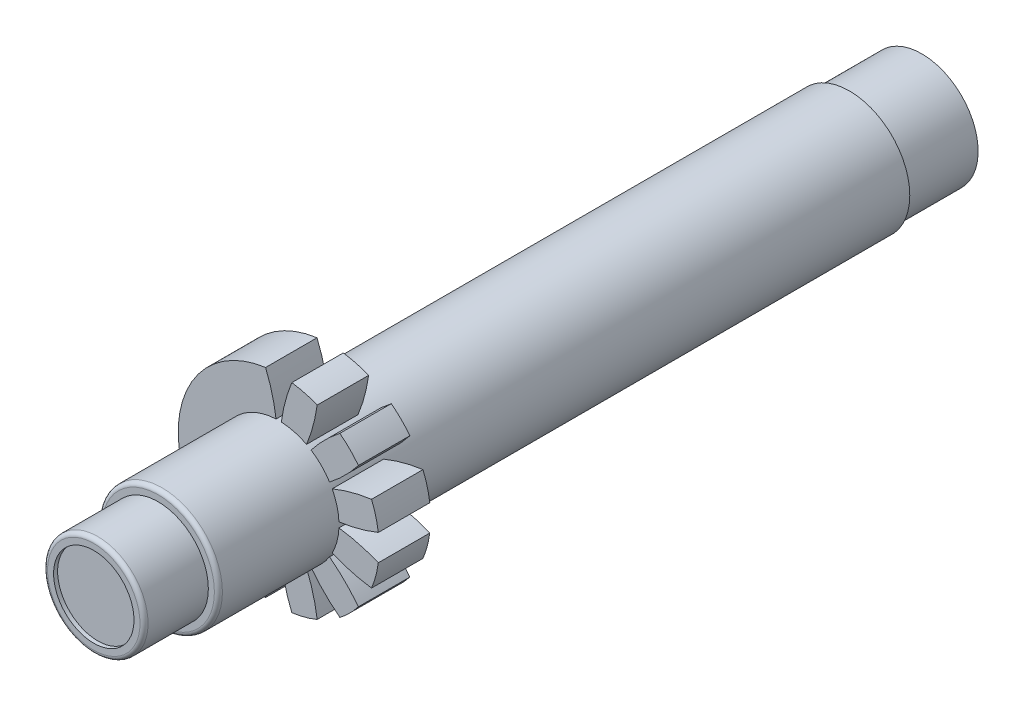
from build123d import *
from build123d.topology import SkipClean

# Parameters (mm, degrees)
SKETCH1_R           = 3.81
BASE_EXTRUDE_DEPTH  = 48.26
SKETCH2_R           = 3.175
BOSS_EXTRUDE1_DEPTH = 4.064
SKETCH3_R           = 2.54
CUT_EXTRUDE1_DEPTH  = 0.254
FILLET1_R           = 0.254
SKETCH4_R           = 4.064
SKETCH4_R_2         = 3.556
CUT_EXTRUDE2_DEPTH  = 4.572
CUT_EXTRUDE3_DEPTH  = 4.572
SKETCH7_R           = 6.35
BOSS_EXTRUDE2_DEPTH = 3.2512
CUT_EXTRUDE4_DEPTH  = 42.620362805
CIRPATTERN1_COUNT   = 9
CIRPATTERN1_ANGLE   = 240


with BuildPart() as part:
    # Sketch1 → Base-Extrude (new body)
    with BuildSketch(Plane.XY):
        Circle(SKETCH1_R)
    extrude(amount=-BASE_EXTRUDE_DEPTH)

    # Sketch2 → Boss-Extrude1 (add)
    with BuildSketch(Plane.XY):
        Circle(SKETCH2_R)
    extrude(amount=BOSS_EXTRUDE1_DEPTH)

    # Sketch3 → Cut-Extrude1 (cut)
    with BuildSketch(Plane.XY.offset(4.064)):
        Circle(SKETCH3_R)
    extrude(amount=-CUT_EXTRUDE1_DEPTH, mode=Mode.SUBTRACT)

    # Fillet1
    fillet1_edges = [part.edges().sort_by_distance(p)[0] for p in [
        (-3.81, 0, 0),
        (-3.175, 0, 4.064),
    ]]
    fillet(fillet1_edges, radius=FILLET1_R)

    # Sketch4 → Cut-Extrude2 (cut)
    with BuildSketch(Plane(origin=(0, 0, -48.26), x_dir=(-1, 0, 0), z_dir=(0, 0, -1))):
        Circle(SKETCH4_R)
        Circle(SKETCH4_R_2, mode=Mode.SUBTRACT)
    extrude(amount=-CUT_EXTRUDE2_DEPTH, mode=Mode.SUBTRACT)

    # Sketch5 → Cut-Extrude3 (cut)
    with BuildSketch(Plane(origin=(0, 0, -48.26), x_dir=(-1, 0, 0), z_dir=(0, 0, -1))):
        with BuildLine():
            Line((-3.292216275, 0.254), (3.292216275, 0.254))
            ThreePointArc((3.292216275, 0.254), (3.302, 0), (3.292216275, -0.254))
            Line((3.292216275, -0.254), (-3.292216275, -0.254))
            ThreePointArc((-3.292216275, -0.254), (-3.302, 0), (-3.292216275, 0.254))
        make_face()
    extrude(amount=-CUT_EXTRUDE3_DEPTH, mode=Mode.SUBTRACT)

    # Sketch7 → Boss-Extrude2 (add)
    with BuildSketch(Plane.XY.offset(-7.62)):
        Circle(SKETCH7_R)
    extrude(amount=-BOSS_EXTRUDE2_DEPTH)

    # Sketch9 → Cut-Extrude4 (cut, through all)
    with BuildSketch(Plane.XY.offset(-7.62)):
        with BuildLine():
            ThreePointArc((0.828838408, 6.295675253), (-2.938e-06, 6.35), (-0.828844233, 6.295674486))
            ThreePointArc((-0.828844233, 6.295674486), (-0.417027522, 5.072450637), (-0.166191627, 3.806373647))
            ThreePointArc((-0.166191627, 3.806373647), (-1.763e-06, 3.81), (0.166188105, 3.806373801))
            ThreePointArc((0.166188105, 3.806373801), (0.417022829, 5.072451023), (0.828838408, 6.295675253))
        make_face()
    cut_extrude4 = extrude(amount=-CUT_EXTRUDE4_DEPTH, mode=Mode.SUBTRACT)

    # CirPattern1: Cut-Extrude4 ×9 about axis
    with SkipClean():  # the faces are left unmerged after this step: merging them gives an invalid solid
        cirpattern1_axis = Axis((0, 0, 0), (0, 0, -1))
        for i in range(1, CIRPATTERN1_COUNT):
            add(cut_extrude4.rotate(cirpattern1_axis, i * CIRPATTERN1_ANGLE / (CIRPATTERN1_COUNT - 1)), mode=Mode.SUBTRACT)


solid = part.part
